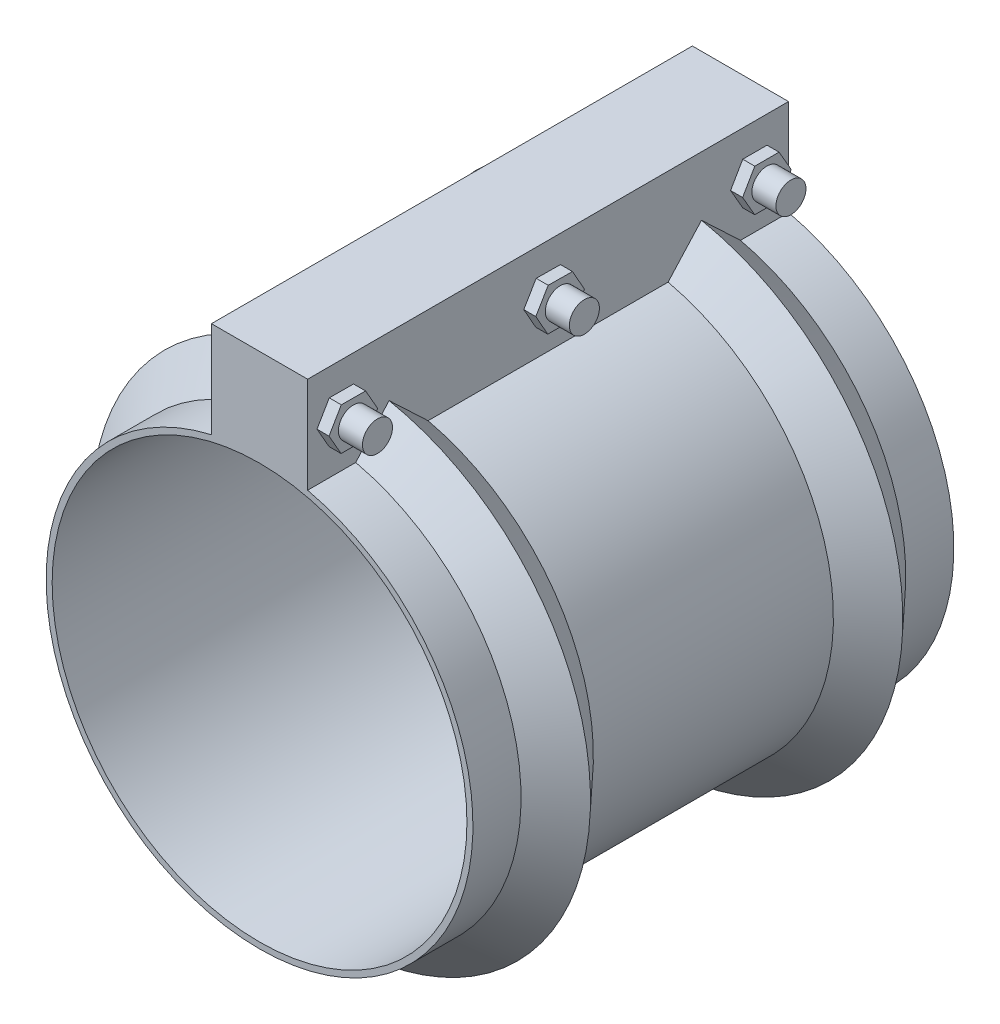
from build123d import *

# Parameters (mm, degrees)
BOSS_EXTRUDE1_DEPTH      = 127
BOSS_EXTRUDE1_DEPTH_BACK = 127
BOSS_EXTRUDE2_DEPTH      = 6.35
SKETCH4_R                = 7.9375
BOSS_EXTRUDE3_DEPTH      = 12.7
SKETCH5_R                = 11.1125
BOSS_EXTRUDE4_DEPTH      = 6.35
FILLET1_R                = 5.08


with BuildPart() as part:
    # Sketch1 → Revolve1 (revolve)
    with BuildSketch(Plane(origin=(0, 0, 0), x_dir=(0, 0, -1), z_dir=(1, 0, 0)), mode=Mode.PRIVATE) as revolve1_sk:
        Polygon((-127, 109.5375), (127, 109.5375), (127, 112.7125), (101.6, 112.7125), (81.011721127, 131.7625), (63.38506558, 112.7125), (-63.38506558, 112.7125), (-83.973344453, 131.7625), (-101.6, 112.7125), (-127, 112.7125), align=None)
    revolve(revolve1_sk.sketch.rotate(Axis((0, 0, 248.174311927), (0, 0, -1)), 90), axis=Axis((0, 0, 248.174311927), (0, 0, -1)))

    # Sketch2 → Boss-Extrude1 (add, two sides: drawn at the far end of the back side and taken through both)
    with BuildSketch(Plane.XY.offset(-BOSS_EXTRUDE1_DEPTH_BACK)):
        with BuildLine():
            Line((-25.4, 160.613239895), (25.4, 160.613239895))
            Line((25.4, 160.613239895), (25.4, 109.813239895))
            ThreePointArc((25.4, 109.813239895), (0, 112.7125), (-25.4, 109.813239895))
            Line((-25.4, 109.813239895), (-25.4, 160.613239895))
        make_face()
    extrude(amount=BOSS_EXTRUDE1_DEPTH + BOSS_EXTRUDE1_DEPTH_BACK)

    # Sketch3 → Boss-Extrude2 (add)
    with BuildSketch(Plane(origin=(25.4, 0, 0), x_dir=(0, 0, -1), z_dir=(1, 0, 0))):
        Polygon((-96.388561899, 135.14687273), (-102.746805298, 146.292407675), (-115.578243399, 146.35877484), (-122.051438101, 135.27960706), (-115.693194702, 124.134072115), (-102.861756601, 124.06770495), align=None)
        Polygon((12.830885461, 135.076907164), (6.533510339, 146.256946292), (-6.297375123, 146.393279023), (-12.830885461, 135.349572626), (-6.533510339, 124.169533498), (6.297375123, 124.033200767), align=None)
        Polygon((122.051609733, 135.213239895), (115.635804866, 146.325739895), (102.804195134, 146.325739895), (96.388390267, 135.213239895), (102.804195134, 124.100739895), (115.635804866, 124.100739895), align=None)
    extrude(amount=BOSS_EXTRUDE2_DEPTH)

    # Sketch4 → Boss-Extrude3 (add)
    with BuildSketch(Plane(origin=(31.75, 0, 0), x_dir=(0, 0, -1), z_dir=(1, 0, 0))):
        with Locations((-109.162524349, 135.14687273)):
            Circle(SKETCH4_R)
        with Locations((0.118067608, 135.076907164)):
            Circle(SKETCH4_R)
        with Locations((109.22, 135.213239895)):
            Circle(SKETCH4_R)
    extrude(amount=BOSS_EXTRUDE3_DEPTH)

    # Sketch5 → Boss-Extrude4 (add)
    with BuildSketch(Plane.ZY.offset(25.4)):
        with Locations(Location((-109.22, 135.213239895, 0), (0, 0, 270))):
            Circle(SKETCH5_R)
        with Locations(Location((0, 135.213239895, 0), (0, 0, 270))):
            Circle(SKETCH5_R)
        with Locations(Location((109.22, 135.213239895, 0), (0, 0, 270))):
            Circle(SKETCH5_R)
    extrude(amount=BOSS_EXTRUDE4_DEPTH)

    # Fillet1
    fillet1_edges = [part.edges().sort_by_distance(p)[0] for p in [
        (-31.75, 146.325739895, -109.22),
        (-31.75, 146.325739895, 0),
        (-31.75, 146.325739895, 109.22),
    ]]
    fillet(fillet1_edges, radius=FILLET1_R)


solid = part.part
